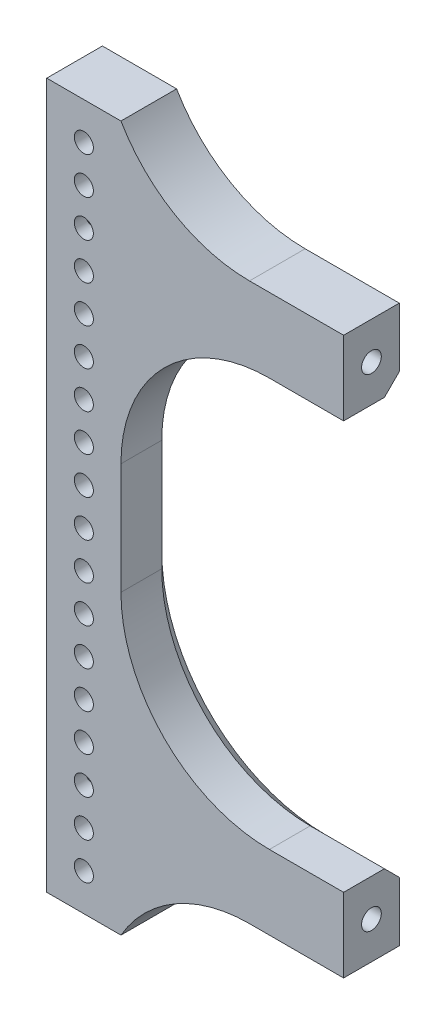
from build123d import *

# Parameters (mm, degrees)
BOSS_EXTRUDE1_DEPTH                                  = 19.05
CBORE_FOR_1_4_SOCKET_HEAD_CAP_SCREW1_D               = 6.7564
CBORE_FOR_1_4_SOCKET_HEAD_CAP_SCREW1_CBORE_D         = 11.1125
CBORE_FOR_1_4_SOCKET_HEAD_CAP_SCREW1_CBORE_DEPTH     = 38.1
CHAMFER1_SIZE                                        = 5.08
CBORE_FOR_1_4_BINDING_HEAD_MACHINE_SCREW_D           = 6.5278
CBORE_FOR_1_4_BINDING_HEAD_MACHINE_SCREW_CBORE_D     = 7.9375
CBORE_FOR_1_4_BINDING_HEAD_MACHINE_SCREW_CBORE_DEPTH = 6.35
F_5_64_0_07813_DIAMETER_HOLE1_AT_2_COUNT             = 2
F_5_64_0_07813_DIAMETER_HOLE1_AT_2_PITCH             = 12.7
F_5_64_0_07813_DIAMETER_HOLE1_AT_3_COUNT             = 2
F_5_64_0_07813_DIAMETER_HOLE1_AT_3_PITCH             = 17.960512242
F_5_64_0_07813_DIAMETER_HOLE1_AT_4_COUNT             = 2
F_5_64_0_07813_DIAMETER_HOLE1_AT_4_PITCH             = 12.7
LPATTERN1_COUNT                                      = 9
LPATTERN1_PITCH                                      = 12.7
MIRROR1_COPY_4_D                                     = 6.5278
MIRROR1_COPY_4_CBORE_D                               = 7.9375
MIRROR1_COPY_4_CBORE_DEPTH                           = 6.35
MIRROR1_COPY_5_D                                     = 6.5278
MIRROR1_COPY_5_CBORE_D                               = 7.9375
MIRROR1_COPY_5_CBORE_DEPTH                           = 6.35
MIRROR1_COPY_6_D                                     = 6.5278
MIRROR1_COPY_6_CBORE_D                               = 7.9375
MIRROR1_COPY_6_CBORE_DEPTH                           = 6.35
MIRROR1_COPY_7_D                                     = 6.5278
MIRROR1_COPY_7_CBORE_D                               = 7.9375
MIRROR1_COPY_7_CBORE_DEPTH                           = 6.35
MIRROR1_COPY_8_D                                     = 6.5278
MIRROR1_COPY_8_CBORE_D                               = 7.9375
MIRROR1_COPY_8_CBORE_DEPTH                           = 6.35
MIRROR1_COPY_9_D                                     = 6.5278
MIRROR1_COPY_9_CBORE_D                               = 7.9375
MIRROR1_COPY_9_CBORE_DEPTH                           = 6.35
MIRROR1_COPY_10_D                                    = 6.5278
MIRROR1_COPY_10_CBORE_D                              = 7.9375
MIRROR1_COPY_10_CBORE_DEPTH                          = 6.35
MIRROR1_COPY_11_D                                    = 6.5278
MIRROR1_COPY_11_CBORE_D                              = 7.9375
MIRROR1_COPY_11_CBORE_DEPTH                          = 6.35


with BuildPart() as part:
    # Sketch1 → Boss-Extrude1 (new body)
    with BuildSketch(Plane.XY):
        with BuildLine():
            Line((101.6, 69.85), (101.6, 95.25))
            Line((101.6, 95.25), (69.394090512, 95.25))
            ThreePointArc((69.394090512, 95.25), (43.994090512, 102.055909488), (25.4, 120.65))
            Line((25.4, 120.65), (0, 120.65))
            Line((0, 120.65), (0, -120.65))
            Line((0, -120.65), (25.4, -120.65))
            ThreePointArc((25.4, -120.65), (43.994090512, -102.055909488), (69.394090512, -95.25))
            Line((69.394090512, -95.25), (101.6, -95.25))
            Line((101.6, -95.25), (101.6, -69.85))
            Line((101.6, -69.85), (76.2, -69.85))
            ThreePointArc((76.2, -69.85), (40.278975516, -54.971024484), (25.4, -19.05))
            Line((25.4, -19.05), (25.4, 19.05))
            ThreePointArc((25.4, 19.05), (40.278975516, 54.971024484), (76.2, 69.85))
            Line((76.2, 69.85), (101.6, 69.85))
        make_face()
    extrude(amount=BOSS_EXTRUDE1_DEPTH)

    # CBORE for 1_4 Socket Head Cap Screw1 (through all)
    with Locations(Plane(origin=(0, 0, 0), x_dir=(0, 0, -1), z_dir=(-1, 0, 0))):
        with Locations((-9.525, -82.55), (-9.525, 82.55)):
            CounterBoreHole(CBORE_FOR_1_4_SOCKET_HEAD_CAP_SCREW1_D / 2, CBORE_FOR_1_4_SOCKET_HEAD_CAP_SCREW1_CBORE_D / 2, CBORE_FOR_1_4_SOCKET_HEAD_CAP_SCREW1_CBORE_DEPTH)

    # Chamfer1
    chamfer1_edges = [part.edges().sort_by_distance(p)[0] for p in [
        (88.9, 69.85, 0),
        (40.278975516, 54.971024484, 0),
        (25.4, 0, 0),
        (40.278975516, -54.971024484, 0),
        (88.9, -69.85, 0),
    ]]
    chamfer(chamfer1_edges, length=CHAMFER1_SIZE)

    # CBORE for 1_4 Binding Head Machine Screw (through all)
    with Locations(Plane(origin=(0, 0, 0), x_dir=(1, 0, 0), z_dir=(0, 0, -1))):
        with Locations((12.7, -107.95)):
            cbore_for_1_4_binding_head_machine_screw = CounterBoreHole(CBORE_FOR_1_4_BINDING_HEAD_MACHINE_SCREW_D / 2, CBORE_FOR_1_4_BINDING_HEAD_MACHINE_SCREW_CBORE_D / 2, CBORE_FOR_1_4_BINDING_HEAD_MACHINE_SCREW_CBORE_DEPTH)

    # Sketch7 → 5_64 _0.07813_ Diameter Hole1 (revolve, cut)
    with BuildSketch(Plane(origin=(19.05, 114.3, 0), x_dir=(0, 1, 0), z_dir=(1, 0, 0))):
        Polygon((0, 0), (0, 5.16820455), (0.992251, 4.572), (0.992251, 0), align=None)
    f_5_64_0_07813_diameter_hole1 = revolve(axis=Axis((19.05, 114.3, -6.35), (0, 0, 1)), mode=Mode.SUBTRACT)

    # 5_64 _0.07813_ Diameter Hole1 at 2: 5_64 _0.07813_ Diameter Hole1 ×2
    with Locations(*[(-i * F_5_64_0_07813_DIAMETER_HOLE1_AT_2_PITCH, 0, 0) for i in range(1, F_5_64_0_07813_DIAMETER_HOLE1_AT_2_COUNT)]):
        add(f_5_64_0_07813_diameter_hole1, mode=Mode.SUBTRACT)

    # 5_64 _0.07813_ Diameter Hole1 at 3: 5_64 _0.07813_ Diameter Hole1 ×2
    with Locations(*[Vector(-0.7071067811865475, -0.7071067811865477, 0) * (i * F_5_64_0_07813_DIAMETER_HOLE1_AT_3_PITCH) for i in range(1, F_5_64_0_07813_DIAMETER_HOLE1_AT_3_COUNT)]):
        add(f_5_64_0_07813_diameter_hole1, mode=Mode.SUBTRACT)

    # 5_64 _0.07813_ Diameter Hole1 at 4: 5_64 _0.07813_ Diameter Hole1 ×2
    with Locations(*[(0, -i * F_5_64_0_07813_DIAMETER_HOLE1_AT_4_PITCH, 0) for i in range(1, F_5_64_0_07813_DIAMETER_HOLE1_AT_4_COUNT)]):
        add(f_5_64_0_07813_diameter_hole1, mode=Mode.SUBTRACT)

    # LPattern1: CBORE for 1_4 Binding Head Machine Screw, 5_64 _0.07813_ Diameter Hole1 ×9
    with Locations(*[(0, -i * LPATTERN1_PITCH, 0) for i in range(1, LPATTERN1_COUNT)]):
        add(cbore_for_1_4_binding_head_machine_screw, mode=Mode.SUBTRACT)
        add(f_5_64_0_07813_diameter_hole1, mode=Mode.SUBTRACT)

    # LPattern1 copy 1 sketch → LPattern1 copy 1 (revolve, cut)
    with BuildSketch(Plane(origin=(6.35, 101.6, 0), x_dir=(0, 1, 0), z_dir=(1, 0, 0))):
        Polygon((0, 0), (0, 5.16820455), (0.992251, 4.572), (0.992251, 0), align=None)
    revolve(axis=Axis((6.35, 101.6, -6.35), (0, 0, 1)), mode=Mode.SUBTRACT)

    # LPattern1 copy 2 sketch → LPattern1 copy 2 (revolve, cut)
    with BuildSketch(Plane(origin=(6.35, 88.9, 0), x_dir=(0, 1, 0), z_dir=(1, 0, 0))):
        Polygon((0, 0), (0, 5.16820455), (0.992251, 4.572), (0.992251, 0), align=None)
    revolve(axis=Axis((6.35, 88.9, -6.35), (0, 0, 1)), mode=Mode.SUBTRACT)

    # LPattern1 copy 3 sketch → LPattern1 copy 3 (revolve, cut)
    with BuildSketch(Plane(origin=(6.35, 76.2, 0), x_dir=(0, 1, 0), z_dir=(1, 0, 0))):
        Polygon((0, 0), (0, 5.16820455), (0.992251, 4.572), (0.992251, 0), align=None)
    revolve(axis=Axis((6.35, 76.2, -6.35), (0, 0, 1)), mode=Mode.SUBTRACT)

    # LPattern1 copy 4 sketch → LPattern1 copy 4 (revolve, cut)
    with BuildSketch(Plane(origin=(6.35, 63.5, 0), x_dir=(0, 1, 0), z_dir=(1, 0, 0))):
        Polygon((0, 0), (0, 5.16820455), (0.992251, 4.572), (0.992251, 0), align=None)
    revolve(axis=Axis((6.35, 63.5, -6.35), (0, 0, 1)), mode=Mode.SUBTRACT)

    # LPattern1 copy 5 sketch → LPattern1 copy 5 (revolve, cut)
    with BuildSketch(Plane(origin=(6.35, 50.8, 0), x_dir=(0, 1, 0), z_dir=(1, 0, 0))):
        Polygon((0, 0), (0, 5.16820455), (0.992251, 4.572), (0.992251, 0), align=None)
    revolve(axis=Axis((6.35, 50.8, -6.35), (0, 0, 1)), mode=Mode.SUBTRACT)

    # LPattern1 copy 6 sketch → LPattern1 copy 6 (revolve, cut)
    with BuildSketch(Plane(origin=(6.35, 38.1, 0), x_dir=(0, 1, 0), z_dir=(1, 0, 0))):
        Polygon((0, 0), (0, 5.16820455), (0.992251, 4.572), (0.992251, 0), align=None)
    revolve(axis=Axis((6.35, 38.1, -6.35), (0, 0, 1)), mode=Mode.SUBTRACT)

    # LPattern1 copy 7 sketch → LPattern1 copy 7 (revolve, cut)
    with BuildSketch(Plane(origin=(6.35, 25.4, 0), x_dir=(0, 1, 0), z_dir=(1, 0, 0))):
        Polygon((0, 0), (0, 5.16820455), (0.992251, 4.572), (0.992251, 0), align=None)
    revolve(axis=Axis((6.35, 25.4, -6.35), (0, 0, 1)), mode=Mode.SUBTRACT)

    # LPattern1 copy 8 sketch → LPattern1 copy 8 (revolve, cut)
    with BuildSketch(Plane(origin=(6.35, 12.7, 0), x_dir=(0, 1, 0), z_dir=(1, 0, 0))):
        Polygon((0, 0), (0, 5.16820455), (0.992251, 4.572), (0.992251, 0), align=None)
    revolve(axis=Axis((6.35, 12.7, -6.35), (0, 0, 1)), mode=Mode.SUBTRACT)

    # LPattern1 copy 9 sketch → LPattern1 copy 9 (revolve, cut)
    with BuildSketch(Plane(origin=(6.35, 88.9, 0), x_dir=(0, 1, 0), z_dir=(1, 0, 0))):
        Polygon((0, 0), (0, 5.16820455), (0.992251, 4.572), (0.992251, 0), align=None)
    revolve(axis=Axis((6.35, 88.9, -6.35), (0, 0, 1)), mode=Mode.SUBTRACT)

    # LPattern1 copy 10 sketch → LPattern1 copy 10 (revolve, cut)
    with BuildSketch(Plane(origin=(6.35, 76.2, 0), x_dir=(0, 1, 0), z_dir=(1, 0, 0))):
        Polygon((0, 0), (0, 5.16820455), (0.992251, 4.572), (0.992251, 0), align=None)
    revolve(axis=Axis((6.35, 76.2, -6.35), (0, 0, 1)), mode=Mode.SUBTRACT)

    # LPattern1 copy 11 sketch → LPattern1 copy 11 (revolve, cut)
    with BuildSketch(Plane(origin=(6.35, 63.5, 0), x_dir=(0, 1, 0), z_dir=(1, 0, 0))):
        Polygon((0, 0), (0, 5.16820455), (0.992251, 4.572), (0.992251, 0), align=None)
    revolve(axis=Axis((6.35, 63.5, -6.35), (0, 0, 1)), mode=Mode.SUBTRACT)

    # LPattern1 copy 12 sketch → LPattern1 copy 12 (revolve, cut)
    with BuildSketch(Plane(origin=(6.35, 50.8, 0), x_dir=(0, 1, 0), z_dir=(1, 0, 0))):
        Polygon((0, 0), (0, 5.16820455), (0.992251, 4.572), (0.992251, 0), align=None)
    revolve(axis=Axis((6.35, 50.8, -6.35), (0, 0, 1)), mode=Mode.SUBTRACT)

    # LPattern1 copy 13 sketch → LPattern1 copy 13 (revolve, cut)
    with BuildSketch(Plane(origin=(6.35, 38.1, 0), x_dir=(0, 1, 0), z_dir=(1, 0, 0))):
        Polygon((0, 0), (0, 5.16820455), (0.992251, 4.572), (0.992251, 0), align=None)
    revolve(axis=Axis((6.35, 38.1, -6.35), (0, 0, 1)), mode=Mode.SUBTRACT)

    # LPattern1 copy 14 sketch → LPattern1 copy 14 (revolve, cut)
    with BuildSketch(Plane(origin=(6.35, 25.4, 0), x_dir=(0, 1, 0), z_dir=(1, 0, 0))):
        Polygon((0, 0), (0, 5.16820455), (0.992251, 4.572), (0.992251, 0), align=None)
    revolve(axis=Axis((6.35, 25.4, -6.35), (0, 0, 1)), mode=Mode.SUBTRACT)

    # LPattern1 copy 15 sketch → LPattern1 copy 15 (revolve, cut)
    with BuildSketch(Plane(origin=(6.35, 12.7, 0), x_dir=(0, 1, 0), z_dir=(1, 0, 0))):
        Polygon((0, 0), (0, 5.16820455), (0.992251, 4.572), (0.992251, 0), align=None)
    revolve(axis=Axis((6.35, 12.7, -6.35), (0, 0, 1)), mode=Mode.SUBTRACT)

    # LPattern1 copy 16 sketch → LPattern1 copy 16 (revolve, cut)
    with BuildSketch(Plane.YZ.offset(6.35)):
        Polygon((0, 0), (0, 5.16820455), (0.992251, 4.572), (0.992251, 0), align=None)
    revolve(axis=Axis((6.35, 0, -6.35), (0, 0, 1)), mode=Mode.SUBTRACT)

    # LPattern1 copy 17 sketch → LPattern1 copy 17 (revolve, cut)
    with BuildSketch(Plane(origin=(19.05, 88.9, 0), x_dir=(0, 1, 0), z_dir=(1, 0, 0))):
        Polygon((0, 0), (0, 5.16820455), (0.992251, 4.572), (0.992251, 0), align=None)
    revolve(axis=Axis((19.05, 88.9, -6.35), (0, 0, 1)), mode=Mode.SUBTRACT)

    # LPattern1 copy 18 sketch → LPattern1 copy 18 (revolve, cut)
    with BuildSketch(Plane(origin=(19.05, 76.2, 0), x_dir=(0, 1, 0), z_dir=(1, 0, 0))):
        Polygon((0, 0), (0, 5.16820455), (0.992251, 4.572), (0.992251, 0), align=None)
    revolve(axis=Axis((19.05, 76.2, -6.35), (0, 0, 1)), mode=Mode.SUBTRACT)

    # LPattern1 copy 19 sketch → LPattern1 copy 19 (revolve, cut)
    with BuildSketch(Plane(origin=(19.05, 63.5, 0), x_dir=(0, 1, 0), z_dir=(1, 0, 0))):
        Polygon((0, 0), (0, 5.16820455), (0.992251, 4.572), (0.992251, 0), align=None)
    revolve(axis=Axis((19.05, 63.5, -6.35), (0, 0, 1)), mode=Mode.SUBTRACT)

    # LPattern1 copy 20 sketch → LPattern1 copy 20 (revolve, cut)
    with BuildSketch(Plane(origin=(19.05, 50.8, 0), x_dir=(0, 1, 0), z_dir=(1, 0, 0))):
        Polygon((0, 0), (0, 5.16820455), (0.992251, 4.572), (0.992251, 0), align=None)
    revolve(axis=Axis((19.05, 50.8, -6.35), (0, 0, 1)), mode=Mode.SUBTRACT)

    # LPattern1 copy 21 sketch → LPattern1 copy 21 (revolve, cut)
    with BuildSketch(Plane(origin=(19.05, 38.1, 0), x_dir=(0, 1, 0), z_dir=(1, 0, 0))):
        Polygon((0, 0), (0, 5.16820455), (0.992251, 4.572), (0.992251, 0), align=None)
    revolve(axis=Axis((19.05, 38.1, -6.35), (0, 0, 1)), mode=Mode.SUBTRACT)

    # LPattern1 copy 22 sketch → LPattern1 copy 22 (revolve, cut)
    with BuildSketch(Plane(origin=(19.05, 25.4, 0), x_dir=(0, 1, 0), z_dir=(1, 0, 0))):
        Polygon((0, 0), (0, 5.16820455), (0.992251, 4.572), (0.992251, 0), align=None)
    revolve(axis=Axis((19.05, 25.4, -6.35), (0, 0, 1)), mode=Mode.SUBTRACT)

    # LPattern1 copy 23 sketch → LPattern1 copy 23 (revolve, cut)
    with BuildSketch(Plane(origin=(19.05, 12.7, 0), x_dir=(0, 1, 0), z_dir=(1, 0, 0))):
        Polygon((0, 0), (0, 5.16820455), (0.992251, 4.572), (0.992251, 0), align=None)
    revolve(axis=Axis((19.05, 12.7, -6.35), (0, 0, 1)), mode=Mode.SUBTRACT)

    # LPattern1 copy 24 sketch → LPattern1 copy 24 (revolve, cut)
    with BuildSketch(Plane.YZ.offset(19.05)):
        Polygon((0, 0), (0, 5.16820455), (0.992251, 4.572), (0.992251, 0), align=None)
    revolve(axis=Axis((19.05, 0, -6.35), (0, 0, 1)), mode=Mode.SUBTRACT)

    # Mirror1: CBORE for 1_4 Binding Head Machine Screw, 5_64 _0.07813_ Diameter Hole1 across plane
    add(cbore_for_1_4_binding_head_machine_screw.mirror(Plane.ZX), mode=Mode.SUBTRACT)
    add(f_5_64_0_07813_diameter_hole1.mirror(Plane.ZX), mode=Mode.SUBTRACT)

    # Mirror1 copy 1 sketch → Mirror1 copy 1 (revolve, cut)
    with BuildSketch(Plane(origin=(6.35, -114.3, 0), x_dir=(0, -1, 0), z_dir=(1, 0, 0))):
        Polygon((0, 0), (0, -5.16820455), (0.992251, -4.572), (0.992251, 0), align=None)
    revolve(axis=Axis((6.35, -114.3, -6.35), (0, 0, -1)), mode=Mode.SUBTRACT)

    # Mirror1 copy 2 sketch → Mirror1 copy 2 (revolve, cut)
    with BuildSketch(Plane(origin=(6.35, -101.6, 0), x_dir=(0, -1, 0), z_dir=(1, 0, 0))):
        Polygon((0, 0), (0, -5.16820455), (0.992251, -4.572), (0.992251, 0), align=None)
    revolve(axis=Axis((6.35, -101.6, -6.35), (0, 0, -1)), mode=Mode.SUBTRACT)

    # Mirror1 copy 3 sketch → Mirror1 copy 3 (revolve, cut)
    with BuildSketch(Plane(origin=(19.05, -101.6, 0), x_dir=(0, -1, 0), z_dir=(1, 0, 0))):
        Polygon((0, 0), (0, -5.16820455), (0.992251, -4.572), (0.992251, 0), align=None)
    revolve(axis=Axis((19.05, -101.6, -6.35), (0, 0, -1)), mode=Mode.SUBTRACT)

    # Mirror1 copy 4 (through all)
    with Locations(Plane(origin=(0, 12.7, 0), x_dir=(1, 0, 0), z_dir=(0, 0, -1))):
        with Locations((12.7, 107.95)):
            CounterBoreHole(MIRROR1_COPY_4_D / 2, MIRROR1_COPY_4_CBORE_D / 2, MIRROR1_COPY_4_CBORE_DEPTH)

    # Mirror1 copy 5 (through all)
    with Locations(Plane(origin=(0, 25.4, 0), x_dir=(1, 0, 0), z_dir=(0, 0, -1))):
        with Locations((12.7, 107.95)):
            CounterBoreHole(MIRROR1_COPY_5_D / 2, MIRROR1_COPY_5_CBORE_D / 2, MIRROR1_COPY_5_CBORE_DEPTH)

    # Mirror1 copy 6 (through all)
    with Locations(Plane(origin=(0, 38.1, 0), x_dir=(1, 0, 0), z_dir=(0, 0, -1))):
        with Locations((12.7, 107.95)):
            CounterBoreHole(MIRROR1_COPY_6_D / 2, MIRROR1_COPY_6_CBORE_D / 2, MIRROR1_COPY_6_CBORE_DEPTH)

    # Mirror1 copy 7 (through all)
    with Locations(Plane(origin=(0, 50.8, 0), x_dir=(1, 0, 0), z_dir=(0, 0, -1))):
        with Locations((12.7, 107.95)):
            CounterBoreHole(MIRROR1_COPY_7_D / 2, MIRROR1_COPY_7_CBORE_D / 2, MIRROR1_COPY_7_CBORE_DEPTH)

    # Mirror1 copy 8 (through all)
    with Locations(Plane(origin=(0, 63.5, 0), x_dir=(1, 0, 0), z_dir=(0, 0, -1))):
        with Locations((12.7, 107.95)):
            CounterBoreHole(MIRROR1_COPY_8_D / 2, MIRROR1_COPY_8_CBORE_D / 2, MIRROR1_COPY_8_CBORE_DEPTH)

    # Mirror1 copy 9 (through all)
    with Locations(Plane(origin=(0, 76.2, 0), x_dir=(1, 0, 0), z_dir=(0, 0, -1))):
        with Locations((12.7, 107.95)):
            CounterBoreHole(MIRROR1_COPY_9_D / 2, MIRROR1_COPY_9_CBORE_D / 2, MIRROR1_COPY_9_CBORE_DEPTH)

    # Mirror1 copy 10 (through all)
    with Locations(Plane(origin=(0, 88.9, 0), x_dir=(1, 0, 0), z_dir=(0, 0, -1))):
        with Locations((12.7, 107.95)):
            CounterBoreHole(MIRROR1_COPY_10_D / 2, MIRROR1_COPY_10_CBORE_D / 2, MIRROR1_COPY_10_CBORE_DEPTH)

    # Mirror1 copy 11 (through all)
    with Locations(Plane(origin=(0, 101.6, 0), x_dir=(1, 0, 0), z_dir=(0, 0, -1))):
        with Locations((12.7, 107.95)):
            CounterBoreHole(MIRROR1_COPY_11_D / 2, MIRROR1_COPY_11_CBORE_D / 2, MIRROR1_COPY_11_CBORE_DEPTH)

    # Mirror1 copy 12 sketch → Mirror1 copy 12 (revolve, cut)
    with BuildSketch(Plane(origin=(19.05, -101.6, 0), x_dir=(0, -1, 0), z_dir=(1, 0, 0))):
        Polygon((0, 0), (0, -5.16820455), (0.992251, -4.572), (0.992251, 0), align=None)
    revolve(axis=Axis((19.05, -101.6, -6.35), (0, 0, -1)), mode=Mode.SUBTRACT)

    # Mirror1 copy 13 sketch → Mirror1 copy 13 (revolve, cut)
    with BuildSketch(Plane(origin=(19.05, -88.9, 0), x_dir=(0, -1, 0), z_dir=(1, 0, 0))):
        Polygon((0, 0), (0, -5.16820455), (0.992251, -4.572), (0.992251, 0), align=None)
    revolve(axis=Axis((19.05, -88.9, -6.35), (0, 0, -1)), mode=Mode.SUBTRACT)

    # Mirror1 copy 14 sketch → Mirror1 copy 14 (revolve, cut)
    with BuildSketch(Plane(origin=(19.05, -76.2, 0), x_dir=(0, -1, 0), z_dir=(1, 0, 0))):
        Polygon((0, 0), (0, -5.16820455), (0.992251, -4.572), (0.992251, 0), align=None)
    revolve(axis=Axis((19.05, -76.2, -6.35), (0, 0, -1)), mode=Mode.SUBTRACT)

    # Mirror1 copy 15 sketch → Mirror1 copy 15 (revolve, cut)
    with BuildSketch(Plane(origin=(19.05, -63.5, 0), x_dir=(0, -1, 0), z_dir=(1, 0, 0))):
        Polygon((0, 0), (0, -5.16820455), (0.992251, -4.572), (0.992251, 0), align=None)
    revolve(axis=Axis((19.05, -63.5, -6.35), (0, 0, -1)), mode=Mode.SUBTRACT)

    # Mirror1 copy 16 sketch → Mirror1 copy 16 (revolve, cut)
    with BuildSketch(Plane(origin=(19.05, -50.8, 0), x_dir=(0, -1, 0), z_dir=(1, 0, 0))):
        Polygon((0, 0), (0, -5.16820455), (0.992251, -4.572), (0.992251, 0), align=None)
    revolve(axis=Axis((19.05, -50.8, -6.35), (0, 0, -1)), mode=Mode.SUBTRACT)

    # Mirror1 copy 17 sketch → Mirror1 copy 17 (revolve, cut)
    with BuildSketch(Plane(origin=(19.05, -38.1, 0), x_dir=(0, -1, 0), z_dir=(1, 0, 0))):
        Polygon((0, 0), (0, -5.16820455), (0.992251, -4.572), (0.992251, 0), align=None)
    revolve(axis=Axis((19.05, -38.1, -6.35), (0, 0, -1)), mode=Mode.SUBTRACT)

    # Mirror1 copy 18 sketch → Mirror1 copy 18 (revolve, cut)
    with BuildSketch(Plane(origin=(19.05, -25.4, 0), x_dir=(0, -1, 0), z_dir=(1, 0, 0))):
        Polygon((0, 0), (0, -5.16820455), (0.992251, -4.572), (0.992251, 0), align=None)
    revolve(axis=Axis((19.05, -25.4, -6.35), (0, 0, -1)), mode=Mode.SUBTRACT)

    # Mirror1 copy 19 sketch → Mirror1 copy 19 (revolve, cut)
    with BuildSketch(Plane(origin=(19.05, -12.7, 0), x_dir=(0, -1, 0), z_dir=(1, 0, 0))):
        Polygon((0, 0), (0, -5.16820455), (0.992251, -4.572), (0.992251, 0), align=None)
    revolve(axis=Axis((19.05, -12.7, -6.35), (0, 0, -1)), mode=Mode.SUBTRACT)

    # Mirror1 copy 20 sketch → Mirror1 copy 20 (revolve, cut)
    with BuildSketch(Plane(origin=(6.35, -101.6, 0), x_dir=(0, -1, 0), z_dir=(1, 0, 0))):
        Polygon((0, 0), (0, -5.16820455), (0.992251, -4.572), (0.992251, 0), align=None)
    revolve(axis=Axis((6.35, -101.6, -6.35), (0, 0, -1)), mode=Mode.SUBTRACT)

    # Mirror1 copy 21 sketch → Mirror1 copy 21 (revolve, cut)
    with BuildSketch(Plane(origin=(6.35, -88.9, 0), x_dir=(0, -1, 0), z_dir=(1, 0, 0))):
        Polygon((0, 0), (0, -5.16820455), (0.992251, -4.572), (0.992251, 0), align=None)
    revolve(axis=Axis((6.35, -88.9, -6.35), (0, 0, -1)), mode=Mode.SUBTRACT)

    # Mirror1 copy 22 sketch → Mirror1 copy 22 (revolve, cut)
    with BuildSketch(Plane(origin=(6.35, -76.2, 0), x_dir=(0, -1, 0), z_dir=(1, 0, 0))):
        Polygon((0, 0), (0, -5.16820455), (0.992251, -4.572), (0.992251, 0), align=None)
    revolve(axis=Axis((6.35, -76.2, -6.35), (0, 0, -1)), mode=Mode.SUBTRACT)

    # Mirror1 copy 23 sketch → Mirror1 copy 23 (revolve, cut)
    with BuildSketch(Plane(origin=(6.35, -63.5, 0), x_dir=(0, -1, 0), z_dir=(1, 0, 0))):
        Polygon((0, 0), (0, -5.16820455), (0.992251, -4.572), (0.992251, 0), align=None)
    revolve(axis=Axis((6.35, -63.5, -6.35), (0, 0, -1)), mode=Mode.SUBTRACT)

    # Mirror1 copy 24 sketch → Mirror1 copy 24 (revolve, cut)
    with BuildSketch(Plane(origin=(6.35, -50.8, 0), x_dir=(0, -1, 0), z_dir=(1, 0, 0))):
        Polygon((0, 0), (0, -5.16820455), (0.992251, -4.572), (0.992251, 0), align=None)
    revolve(axis=Axis((6.35, -50.8, -6.35), (0, 0, -1)), mode=Mode.SUBTRACT)

    # Mirror1 copy 25 sketch → Mirror1 copy 25 (revolve, cut)
    with BuildSketch(Plane(origin=(6.35, -38.1, 0), x_dir=(0, -1, 0), z_dir=(1, 0, 0))):
        Polygon((0, 0), (0, -5.16820455), (0.992251, -4.572), (0.992251, 0), align=None)
    revolve(axis=Axis((6.35, -38.1, -6.35), (0, 0, -1)), mode=Mode.SUBTRACT)

    # Mirror1 copy 26 sketch → Mirror1 copy 26 (revolve, cut)
    with BuildSketch(Plane(origin=(6.35, -25.4, 0), x_dir=(0, -1, 0), z_dir=(1, 0, 0))):
        Polygon((0, 0), (0, -5.16820455), (0.992251, -4.572), (0.992251, 0), align=None)
    revolve(axis=Axis((6.35, -25.4, -6.35), (0, 0, -1)), mode=Mode.SUBTRACT)

    # Mirror1 copy 27 sketch → Mirror1 copy 27 (revolve, cut)
    with BuildSketch(Plane(origin=(6.35, -12.7, 0), x_dir=(0, -1, 0), z_dir=(1, 0, 0))):
        Polygon((0, 0), (0, -5.16820455), (0.992251, -4.572), (0.992251, 0), align=None)
    revolve(axis=Axis((6.35, -12.7, -6.35), (0, 0, -1)), mode=Mode.SUBTRACT)

    # Mirror1 copy 28 sketch → Mirror1 copy 28 (revolve, cut)
    with BuildSketch(Plane(origin=(6.35, -88.9, 0), x_dir=(0, -1, 0), z_dir=(1, 0, 0))):
        Polygon((0, 0), (0, -5.16820455), (0.992251, -4.572), (0.992251, 0), align=None)
    revolve(axis=Axis((6.35, -88.9, -6.35), (0, 0, -1)), mode=Mode.SUBTRACT)

    # Mirror1 copy 29 sketch → Mirror1 copy 29 (revolve, cut)
    with BuildSketch(Plane(origin=(6.35, -76.2, 0), x_dir=(0, -1, 0), z_dir=(1, 0, 0))):
        Polygon((0, 0), (0, -5.16820455), (0.992251, -4.572), (0.992251, 0), align=None)
    revolve(axis=Axis((6.35, -76.2, -6.35), (0, 0, -1)), mode=Mode.SUBTRACT)

    # Mirror1 copy 30 sketch → Mirror1 copy 30 (revolve, cut)
    with BuildSketch(Plane(origin=(6.35, -63.5, 0), x_dir=(0, -1, 0), z_dir=(1, 0, 0))):
        Polygon((0, 0), (0, -5.16820455), (0.992251, -4.572), (0.992251, 0), align=None)
    revolve(axis=Axis((6.35, -63.5, -6.35), (0, 0, -1)), mode=Mode.SUBTRACT)

    # Mirror1 copy 31 sketch → Mirror1 copy 31 (revolve, cut)
    with BuildSketch(Plane(origin=(6.35, -50.8, 0), x_dir=(0, -1, 0), z_dir=(1, 0, 0))):
        Polygon((0, 0), (0, -5.16820455), (0.992251, -4.572), (0.992251, 0), align=None)
    revolve(axis=Axis((6.35, -50.8, -6.35), (0, 0, -1)), mode=Mode.SUBTRACT)

    # Mirror1 copy 32 sketch → Mirror1 copy 32 (revolve, cut)
    with BuildSketch(Plane(origin=(6.35, -38.1, 0), x_dir=(0, -1, 0), z_dir=(1, 0, 0))):
        Polygon((0, 0), (0, -5.16820455), (0.992251, -4.572), (0.992251, 0), align=None)
    revolve(axis=Axis((6.35, -38.1, -6.35), (0, 0, -1)), mode=Mode.SUBTRACT)

    # Mirror1 copy 33 sketch → Mirror1 copy 33 (revolve, cut)
    with BuildSketch(Plane(origin=(6.35, -25.4, 0), x_dir=(0, -1, 0), z_dir=(1, 0, 0))):
        Polygon((0, 0), (0, -5.16820455), (0.992251, -4.572), (0.992251, 0), align=None)
    revolve(axis=Axis((6.35, -25.4, -6.35), (0, 0, -1)), mode=Mode.SUBTRACT)

    # Mirror1 copy 34 sketch → Mirror1 copy 34 (revolve, cut)
    with BuildSketch(Plane(origin=(6.35, -12.7, 0), x_dir=(0, -1, 0), z_dir=(1, 0, 0))):
        Polygon((0, 0), (0, -5.16820455), (0.992251, -4.572), (0.992251, 0), align=None)
    revolve(axis=Axis((6.35, -12.7, -6.35), (0, 0, -1)), mode=Mode.SUBTRACT)

    # Mirror1 copy 35 sketch → Mirror1 copy 35 (revolve, cut)
    with BuildSketch(Plane(origin=(6.35, 0, 0), x_dir=(0, -1, 0), z_dir=(1, 0, 0))):
        Polygon((0, 0), (0, -5.16820455), (0.992251, -4.572), (0.992251, 0), align=None)
    revolve(axis=Axis((6.35, 0, -6.35), (0, 0, -1)), mode=Mode.SUBTRACT)

    # Mirror1 copy 36 sketch → Mirror1 copy 36 (revolve, cut)
    with BuildSketch(Plane(origin=(19.05, -88.9, 0), x_dir=(0, -1, 0), z_dir=(1, 0, 0))):
        Polygon((0, 0), (0, -5.16820455), (0.992251, -4.572), (0.992251, 0), align=None)
    revolve(axis=Axis((19.05, -88.9, -6.35), (0, 0, -1)), mode=Mode.SUBTRACT)

    # Mirror1 copy 37 sketch → Mirror1 copy 37 (revolve, cut)
    with BuildSketch(Plane(origin=(19.05, -76.2, 0), x_dir=(0, -1, 0), z_dir=(1, 0, 0))):
        Polygon((0, 0), (0, -5.16820455), (0.992251, -4.572), (0.992251, 0), align=None)
    revolve(axis=Axis((19.05, -76.2, -6.35), (0, 0, -1)), mode=Mode.SUBTRACT)

    # Mirror1 copy 38 sketch → Mirror1 copy 38 (revolve, cut)
    with BuildSketch(Plane(origin=(19.05, -63.5, 0), x_dir=(0, -1, 0), z_dir=(1, 0, 0))):
        Polygon((0, 0), (0, -5.16820455), (0.992251, -4.572), (0.992251, 0), align=None)
    revolve(axis=Axis((19.05, -63.5, -6.35), (0, 0, -1)), mode=Mode.SUBTRACT)

    # Mirror1 copy 39 sketch → Mirror1 copy 39 (revolve, cut)
    with BuildSketch(Plane(origin=(19.05, -50.8, 0), x_dir=(0, -1, 0), z_dir=(1, 0, 0))):
        Polygon((0, 0), (0, -5.16820455), (0.992251, -4.572), (0.992251, 0), align=None)
    revolve(axis=Axis((19.05, -50.8, -6.35), (0, 0, -1)), mode=Mode.SUBTRACT)

    # Mirror1 copy 40 sketch → Mirror1 copy 40 (revolve, cut)
    with BuildSketch(Plane(origin=(19.05, -38.1, 0), x_dir=(0, -1, 0), z_dir=(1, 0, 0))):
        Polygon((0, 0), (0, -5.16820455), (0.992251, -4.572), (0.992251, 0), align=None)
    revolve(axis=Axis((19.05, -38.1, -6.35), (0, 0, -1)), mode=Mode.SUBTRACT)

    # Mirror1 copy 41 sketch → Mirror1 copy 41 (revolve, cut)
    with BuildSketch(Plane(origin=(19.05, -25.4, 0), x_dir=(0, -1, 0), z_dir=(1, 0, 0))):
        Polygon((0, 0), (0, -5.16820455), (0.992251, -4.572), (0.992251, 0), align=None)
    revolve(axis=Axis((19.05, -25.4, -6.35), (0, 0, -1)), mode=Mode.SUBTRACT)

    # Mirror1 copy 42 sketch → Mirror1 copy 42 (revolve, cut)
    with BuildSketch(Plane(origin=(19.05, -12.7, 0), x_dir=(0, -1, 0), z_dir=(1, 0, 0))):
        Polygon((0, 0), (0, -5.16820455), (0.992251, -4.572), (0.992251, 0), align=None)
    revolve(axis=Axis((19.05, -12.7, -6.35), (0, 0, -1)), mode=Mode.SUBTRACT)

    # Mirror1 copy 43 sketch → Mirror1 copy 43 (revolve, cut)
    with BuildSketch(Plane(origin=(19.05, 0, 0), x_dir=(0, -1, 0), z_dir=(1, 0, 0))):
        Polygon((0, 0), (0, -5.16820455), (0.992251, -4.572), (0.992251, 0), align=None)
    revolve(axis=Axis((19.05, 0, -6.35), (0, 0, -1)), mode=Mode.SUBTRACT)


solid = part.part
